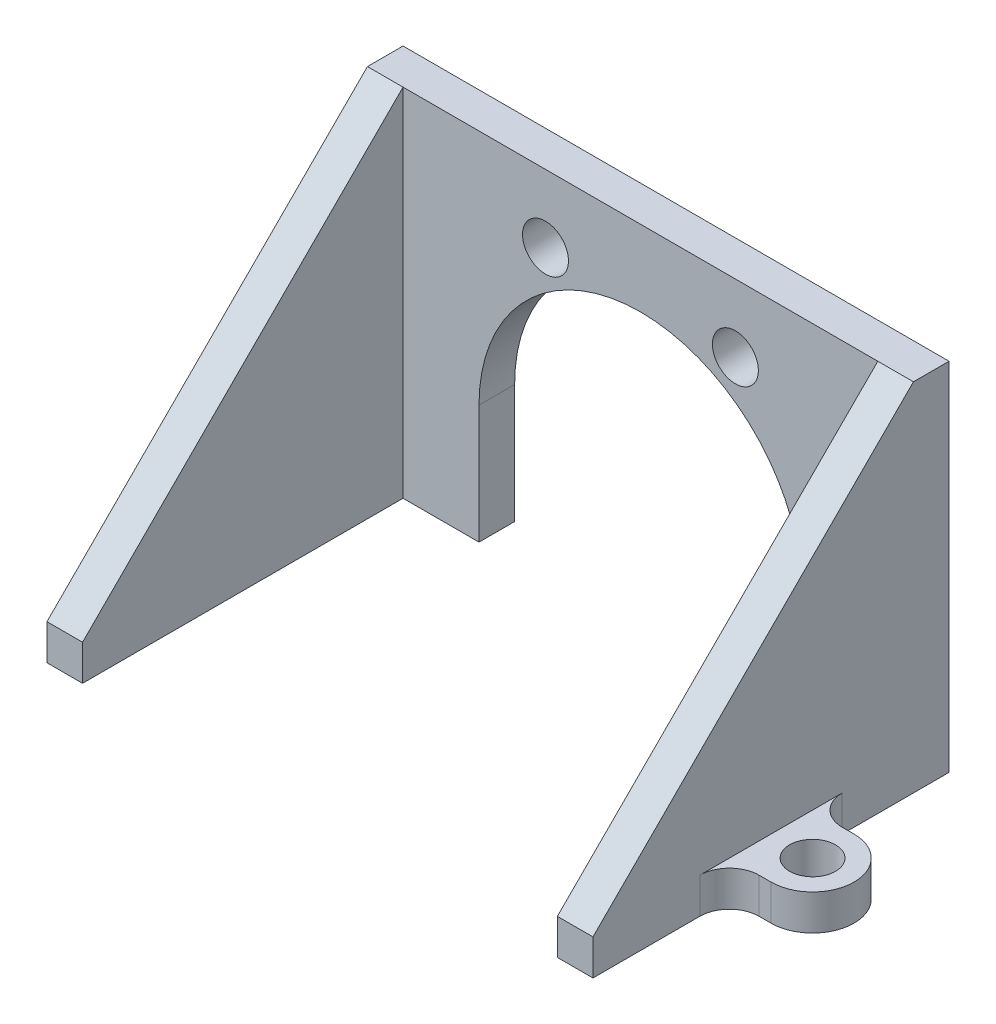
ISO-10303-21;
HEADER;
FILE_DESCRIPTION(('STEP AP214'),'2;1');
FILE_NAME('part.step','',(''),(''),'','','');
FILE_SCHEMA(('AUTOMOTIVE_DESIGN { 1 0 10303 214 1 1 1 1 }'));
ENDSEC;
DATA;
#1=APPLICATION_CONTEXT('core data for automotive mechanical design processes');
#2=APPLICATION_PROTOCOL_DEFINITION('international standard','automotive_design',2000,#1);
#3=PRODUCT_CONTEXT('',#1,'mechanical');
#4=PRODUCT('Part','Part','',(#3));
#5=PRODUCT_RELATED_PRODUCT_CATEGORY('part','',(#4));
#6=PRODUCT_DEFINITION_FORMATION('','',#4);
#7=PRODUCT_DEFINITION_CONTEXT('part definition',#1,'design');
#8=PRODUCT_DEFINITION('design','',#6,#7);
#9=PRODUCT_DEFINITION_SHAPE('','',#8);
#10=(LENGTH_UNIT() NAMED_UNIT(*) SI_UNIT(.MILLI.,.METRE.));
#11=(NAMED_UNIT(*) PLANE_ANGLE_UNIT() SI_UNIT($,.RADIAN.));
#12=(NAMED_UNIT(*) SI_UNIT($,.STERADIAN.) SOLID_ANGLE_UNIT());
#13=UNCERTAINTY_MEASURE_WITH_UNIT(LENGTH_MEASURE(1.E-05),#10,'distance_accuracy_value','');
#14=(GEOMETRIC_REPRESENTATION_CONTEXT(3) GLOBAL_UNCERTAINTY_ASSIGNED_CONTEXT((#13)) GLOBAL_UNIT_ASSIGNED_CONTEXT((#10,
#11,#12)) REPRESENTATION_CONTEXT('',''));
#15=CARTESIAN_POINT('',(0.,0.,0.));
#16=DIRECTION('',(0.,0.,1.));
#17=DIRECTION('',(1.,0.,0.));
#18=AXIS2_PLACEMENT_3D('',#15,#16,#17);
#19=CARTESIAN_POINT('',(29.21,0.,38.1));
#20=DIRECTION('',(0.,1.,0.));
#21=DIRECTION('',(0.,0.,1.));
#22=AXIS2_PLACEMENT_3D('',#19,#20,#21);
#23=PLANE('',#22);
#24=CARTESIAN_POINT('',(-33.655,0.,19.05));
#25=DIRECTION('',(0.,1.,0.));
#26=DIRECTION('',(0.,0.,1.));
#27=AXIS2_PLACEMENT_3D('',#24,#25,#26);
#28=CIRCLE('',#27,2.45744999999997);
#29=CARTESIAN_POINT('',(-33.655,0.,21.50745));
#30=VERTEX_POINT('',#29);
#31=EDGE_CURVE('E241',#30,#30,#28,.T.);
#32=ORIENTED_EDGE('',*,*,#31,.T.);
#33=EDGE_LOOP('',(#32));
#34=FACE_BOUND('',#33,.T.);
#35=DIRECTION('',(-1.,0.,0.));
#36=VECTOR('',#35,1.);
#37=CARTESIAN_POINT('',(29.21,0.,0.));
#38=LINE('',#37,#36);
#39=CARTESIAN_POINT('',(-17.272,0.,0.));
#40=VERTEX_POINT('',#39);
#41=CARTESIAN_POINT('',(-29.21,0.,0.));
#42=VERTEX_POINT('',#41);
#43=EDGE_CURVE('E409',#40,#42,#38,.T.);
#44=ORIENTED_EDGE('',*,*,#43,.F.);
#45=DIRECTION('',(0.,0.,-1.));
#46=VECTOR('',#45,1.);
#47=CARTESIAN_POINT('',(-17.272,0.,38.1));
#48=LINE('',#47,#46);
#49=CARTESIAN_POINT('',(-17.272,0.,3.81000000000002));
#50=VERTEX_POINT('',#49);
#51=EDGE_CURVE('E236',#50,#40,#48,.T.);
#52=ORIENTED_EDGE('',*,*,#51,.F.);
#53=DIRECTION('',(-1.,0.,0.));
#54=VECTOR('',#53,1.);
#55=CARTESIAN_POINT('',(-25.4,0.,3.81000000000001));
#56=LINE('',#55,#54);
#57=CARTESIAN_POINT('',(-25.4,0.,3.81000000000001));
#58=VERTEX_POINT('',#57);
#59=EDGE_CURVE('E300',#50,#58,#56,.T.);
#60=ORIENTED_EDGE('',*,*,#59,.T.);
#61=DIRECTION('',(0.,0.,1.));
#62=VECTOR('',#61,1.);
#63=CARTESIAN_POINT('',(-25.4,0.,3.81000000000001));
#64=LINE('',#63,#62);
#65=CARTESIAN_POINT('',(-25.4,0.,38.1));
#66=VERTEX_POINT('',#65);
#67=EDGE_CURVE('E304',#58,#66,#64,.T.);
#68=ORIENTED_EDGE('',*,*,#67,.T.);
#69=DIRECTION('',(-1.,0.,0.));
#70=VECTOR('',#69,1.);
#71=CARTESIAN_POINT('',(29.21,0.,38.1));
#72=LINE('',#71,#70);
#73=CARTESIAN_POINT('',(-29.21,0.,38.1));
#74=VERTEX_POINT('',#73);
#75=EDGE_CURVE('E397',#66,#74,#72,.T.);
#76=ORIENTED_EDGE('',*,*,#75,.T.);
#77=DIRECTION('',(0.,0.,-1.));
#78=VECTOR('',#77,1.);
#79=CARTESIAN_POINT('',(-29.21,0.,38.1));
#80=LINE('',#79,#78);
#81=CARTESIAN_POINT('',(-29.21,0.,26.67));
#82=VERTEX_POINT('',#81);
#83=EDGE_CURVE('E349',#74,#82,#80,.T.);
#84=ORIENTED_EDGE('',*,*,#83,.T.);
#85=CARTESIAN_POINT('',(-32.385,0.,26.67));
#86=DIRECTION('',(0.,1.,0.));
#87=DIRECTION('',(0.,0.,1.));
#88=AXIS2_PLACEMENT_3D('',#85,#86,#87);
#89=CIRCLE('',#88,3.175);
#90=CARTESIAN_POINT('',(-32.385,0.,23.495));
#91=VERTEX_POINT('',#90);
#92=EDGE_CURVE('E440',#82,#91,#89,.T.);
#93=ORIENTED_EDGE('',*,*,#92,.T.);
#94=DIRECTION('',(-1.,0.,0.));
#95=VECTOR('',#94,1.);
#96=CARTESIAN_POINT('',(-33.655,0.,23.495));
#97=LINE('',#96,#95);
#98=CARTESIAN_POINT('',(-33.655,0.,23.495));
#99=VERTEX_POINT('',#98);
#100=EDGE_CURVE('E275',#91,#99,#97,.T.);
#101=ORIENTED_EDGE('',*,*,#100,.T.);
#102=CARTESIAN_POINT('',(-33.655,0.,19.05));
#103=DIRECTION('',(0.,-1.,0.));
#104=DIRECTION('',(0.,0.,-1.));
#105=AXIS2_PLACEMENT_3D('',#102,#103,#104);
#106=CIRCLE('',#105,4.445);
#107=CARTESIAN_POINT('',(-33.655,0.,14.605));
#108=VERTEX_POINT('',#107);
#109=EDGE_CURVE('E269',#99,#108,#106,.T.);
#110=ORIENTED_EDGE('',*,*,#109,.T.);
#111=DIRECTION('',(1.,0.,0.));
#112=VECTOR('',#111,1.);
#113=CARTESIAN_POINT('',(-33.655,0.,14.605));
#114=LINE('',#113,#112);
#115=CARTESIAN_POINT('',(-32.385,0.,14.605));
#116=VERTEX_POINT('',#115);
#117=EDGE_CURVE('E285',#108,#116,#114,.T.);
#118=ORIENTED_EDGE('',*,*,#117,.T.);
#119=CARTESIAN_POINT('',(-32.385,0.,11.43));
#120=DIRECTION('',(0.,1.,0.));
#121=DIRECTION('',(0.,0.,1.));
#122=AXIS2_PLACEMENT_3D('',#119,#120,#121);
#123=CIRCLE('',#122,3.175);
#124=CARTESIAN_POINT('',(-29.21,0.,11.43));
#125=VERTEX_POINT('',#124);
#126=EDGE_CURVE('E357',#116,#125,#123,.T.);
#127=ORIENTED_EDGE('',*,*,#126,.T.);
#128=EDGE_CURVE('E315',#125,#42,#80,.T.);
#129=ORIENTED_EDGE('',*,*,#128,.T.);
#130=EDGE_LOOP('',(#44,#52,#60,#68,#76,#84,#93,#101,#110,#118,#127,#129));
#131=FACE_BOUND('',#130,.T.);
#132=ADVANCED_FACE('F39',(#34,#131),#23,.F.);
#133=CARTESIAN_POINT('',(-29.21,0.,0.));
#134=DIRECTION('',(1.,0.,0.));
#135=DIRECTION('',(0.,0.,-1.));
#136=AXIS2_PLACEMENT_3D('',#133,#134,#135);
#137=PLANE('',#136);
#138=ORIENTED_EDGE('',*,*,#128,.F.);
#139=DIRECTION('',(0.,-1.,0.));
#140=VECTOR('',#139,1.);
#141=CARTESIAN_POINT('',(-29.21,0.,11.43));
#142=LINE('',#141,#140);
#143=CARTESIAN_POINT('',(-29.21,3.81,11.43));
#144=VERTEX_POINT('',#143);
#145=EDGE_CURVE('E372',#125,#144,#142,.F.);
#146=ORIENTED_EDGE('',*,*,#145,.T.);
#147=DIRECTION('',(0.,0.,1.));
#148=VECTOR('',#147,1.);
#149=CARTESIAN_POINT('',(-29.21,3.81,14.605));
#150=LINE('',#149,#148);
#151=CARTESIAN_POINT('',(-29.21,3.81,26.67));
#152=VERTEX_POINT('',#151);
#153=EDGE_CURVE('E278',#144,#152,#150,.T.);
#154=ORIENTED_EDGE('',*,*,#153,.T.);
#155=DIRECTION('',(0.,-1.,0.));
#156=VECTOR('',#155,1.);
#157=CARTESIAN_POINT('',(-29.21,0.,26.67));
#158=LINE('',#157,#156);
#159=EDGE_CURVE('E368',#152,#82,#158,.T.);
#160=ORIENTED_EDGE('',*,*,#159,.T.);
#161=ORIENTED_EDGE('',*,*,#83,.F.);
#162=DIRECTION('',(0.,-1.,0.));
#163=VECTOR('',#162,1.);
#164=CARTESIAN_POINT('',(-29.21,3.81,38.1));
#165=LINE('',#164,#163);
#166=CARTESIAN_POINT('',(-29.21,3.81,38.1));
#167=VERTEX_POINT('',#166);
#168=EDGE_CURVE('E390',#167,#74,#165,.T.);
#169=ORIENTED_EDGE('',*,*,#168,.F.);
#170=DIRECTION('',(0.,-0.707106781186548,0.707106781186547));
#171=VECTOR('',#170,1.);
#172=CARTESIAN_POINT('',(-29.21,38.1,3.81000000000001));
#173=LINE('',#172,#171);
#174=CARTESIAN_POINT('',(-29.21,38.1,3.81000000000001));
#175=VERTEX_POINT('',#174);
#176=EDGE_CURVE('E387',#175,#167,#173,.T.);
#177=ORIENTED_EDGE('',*,*,#176,.F.);
#178=DIRECTION('',(0.,0.,1.));
#179=VECTOR('',#178,1.);
#180=CARTESIAN_POINT('',(-29.21,38.1,0.));
#181=LINE('',#180,#179);
#182=CARTESIAN_POINT('',(-29.21,38.1,0.));
#183=VERTEX_POINT('',#182);
#184=EDGE_CURVE('E384',#183,#175,#181,.T.);
#185=ORIENTED_EDGE('',*,*,#184,.F.);
#186=DIRECTION('',(0.,1.,0.));
#187=VECTOR('',#186,1.);
#188=CARTESIAN_POINT('',(-29.21,0.,0.));
#189=LINE('',#188,#187);
#190=EDGE_CURVE('E381',#42,#183,#189,.T.);
#191=ORIENTED_EDGE('',*,*,#190,.F.);
#192=EDGE_LOOP('',(#138,#146,#154,#160,#161,#169,#177,#185,#191));
#193=FACE_BOUND('',#192,.T.);
#194=ADVANCED_FACE('F417',(#193),#137,.F.);
#195=CARTESIAN_POINT('',(33.655,0.,19.05));
#196=DIRECTION('',(0.,1.,0.));
#197=DIRECTION('',(0.,0.,1.));
#198=AXIS2_PLACEMENT_3D('',#195,#196,#197);
#199=CIRCLE('',#198,2.45744999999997);
#200=CARTESIAN_POINT('',(33.655,0.,21.50745));
#201=VERTEX_POINT('',#200);
#202=EDGE_CURVE('E247',#201,#201,#199,.T.);
#203=ORIENTED_EDGE('',*,*,#202,.T.);
#204=EDGE_LOOP('',(#203));
#205=FACE_BOUND('',#204,.T.);
#206=CARTESIAN_POINT('',(25.4,0.,3.81000000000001));
#207=VERTEX_POINT('',#206);
#208=CARTESIAN_POINT('',(17.272,0.,3.81000000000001));
#209=VERTEX_POINT('',#208);
#210=EDGE_CURVE('E301',#207,#209,#56,.T.);
#211=ORIENTED_EDGE('',*,*,#210,.T.);
#212=DIRECTION('',(0.,0.,-1.));
#213=VECTOR('',#212,1.);
#214=CARTESIAN_POINT('',(17.272,0.,38.1));
#215=LINE('',#214,#213);
#216=CARTESIAN_POINT('',(17.272,0.,0.));
#217=VERTEX_POINT('',#216);
#218=EDGE_CURVE('E54',#209,#217,#215,.T.);
#219=ORIENTED_EDGE('',*,*,#218,.T.);
#220=CARTESIAN_POINT('',(29.21,0.,0.));
#221=VERTEX_POINT('',#220);
#222=EDGE_CURVE('E229',#221,#217,#38,.T.);
#223=ORIENTED_EDGE('',*,*,#222,.F.);
#224=DIRECTION('',(0.,0.,-1.));
#225=VECTOR('',#224,1.);
#226=CARTESIAN_POINT('',(29.21,0.,38.1));
#227=LINE('',#226,#225);
#228=CARTESIAN_POINT('',(29.21,0.,11.43));
#229=VERTEX_POINT('',#228);
#230=EDGE_CURVE('E322',#229,#221,#227,.T.);
#231=ORIENTED_EDGE('',*,*,#230,.F.);
#232=CARTESIAN_POINT('',(32.385,0.,11.43));
#233=DIRECTION('',(0.,1.,0.));
#234=DIRECTION('',(0.,0.,1.));
#235=AXIS2_PLACEMENT_3D('',#232,#233,#234);
#236=CIRCLE('',#235,3.175);
#237=CARTESIAN_POINT('',(32.385,0.,14.605));
#238=VERTEX_POINT('',#237);
#239=EDGE_CURVE('E451',#229,#238,#236,.T.);
#240=ORIENTED_EDGE('',*,*,#239,.T.);
#241=DIRECTION('',(1.,0.,0.));
#242=VECTOR('',#241,1.);
#243=CARTESIAN_POINT('',(33.655,0.,14.605));
#244=LINE('',#243,#242);
#245=CARTESIAN_POINT('',(33.655,0.,14.605));
#246=VERTEX_POINT('',#245);
#247=EDGE_CURVE('E255',#238,#246,#244,.T.);
#248=ORIENTED_EDGE('',*,*,#247,.T.);
#249=CARTESIAN_POINT('',(33.655,0.,19.05));
#250=DIRECTION('',(0.,-1.,0.));
#251=DIRECTION('',(0.,0.,1.));
#252=AXIS2_PLACEMENT_3D('',#249,#250,#251);
#253=CIRCLE('',#252,4.445);
#254=CARTESIAN_POINT('',(33.655,0.,23.495));
#255=VERTEX_POINT('',#254);
#256=EDGE_CURVE('E250',#246,#255,#253,.T.);
#257=ORIENTED_EDGE('',*,*,#256,.T.);
#258=DIRECTION('',(-1.,0.,0.));
#259=VECTOR('',#258,1.);
#260=CARTESIAN_POINT('',(33.655,0.,23.495));
#261=LINE('',#260,#259);
#262=CARTESIAN_POINT('',(32.385,0.,23.495));
#263=VERTEX_POINT('',#262);
#264=EDGE_CURVE('E265',#255,#263,#261,.T.);
#265=ORIENTED_EDGE('',*,*,#264,.T.);
#266=CARTESIAN_POINT('',(32.385,0.,26.67));
#267=DIRECTION('',(0.,1.,0.));
#268=DIRECTION('',(0.,0.,1.));
#269=AXIS2_PLACEMENT_3D('',#266,#267,#268);
#270=CIRCLE('',#269,3.175);
#271=CARTESIAN_POINT('',(29.21,0.,26.67));
#272=VERTEX_POINT('',#271);
#273=EDGE_CURVE('E446',#263,#272,#270,.T.);
#274=ORIENTED_EDGE('',*,*,#273,.T.);
#275=CARTESIAN_POINT('',(29.21,0.,38.1));
#276=VERTEX_POINT('',#275);
#277=EDGE_CURVE('E326',#276,#272,#227,.T.);
#278=ORIENTED_EDGE('',*,*,#277,.F.);
#279=CARTESIAN_POINT('',(25.4,0.,38.1));
#280=VERTEX_POINT('',#279);
#281=EDGE_CURVE('E393',#276,#280,#72,.T.);
#282=ORIENTED_EDGE('',*,*,#281,.T.);
#283=DIRECTION('',(0.,0.,1.));
#284=VECTOR('',#283,1.);
#285=CARTESIAN_POINT('',(25.4,0.,3.81000000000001));
#286=LINE('',#285,#284);
#287=EDGE_CURVE('E309',#207,#280,#286,.T.);
#288=ORIENTED_EDGE('',*,*,#287,.F.);
#289=EDGE_LOOP('',(#211,#219,#223,#231,#240,#248,#257,#265,#274,#278,#282,#288));
#290=FACE_BOUND('',#289,.T.);
#291=ADVANCED_FACE('F429',(#205,#290),#23,.F.);
#292=CARTESIAN_POINT('',(29.21,38.1,3.81000000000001));
#293=DIRECTION('',(0.,-0.707106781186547,-0.707106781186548));
#294=DIRECTION('',(0.,0.707106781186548,-0.707106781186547));
#295=AXIS2_PLACEMENT_3D('',#292,#293,#294);
#296=PLANE('',#295);
#297=DIRECTION('',(0.,-0.707106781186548,0.707106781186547));
#298=VECTOR('',#297,1.);
#299=CARTESIAN_POINT('',(-25.4,38.1,3.81));
#300=LINE('',#299,#298);
#301=CARTESIAN_POINT('',(-25.4,38.1,3.81000000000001));
#302=VERTEX_POINT('',#301);
#303=CARTESIAN_POINT('',(-25.4,3.81,38.1));
#304=VERTEX_POINT('',#303);
#305=EDGE_CURVE('E313',#302,#304,#300,.T.);
#306=ORIENTED_EDGE('',*,*,#305,.F.);
#307=DIRECTION('',(-1.,0.,0.));
#308=VECTOR('',#307,1.);
#309=CARTESIAN_POINT('',(29.21,38.1,3.81000000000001));
#310=LINE('',#309,#308);
#311=EDGE_CURVE('E401',#302,#175,#310,.T.);
#312=ORIENTED_EDGE('',*,*,#311,.T.);
#313=ORIENTED_EDGE('',*,*,#176,.T.);
#314=DIRECTION('',(-1.,0.,0.));
#315=VECTOR('',#314,1.);
#316=CARTESIAN_POINT('',(29.21,3.81,38.1));
#317=LINE('',#316,#315);
#318=EDGE_CURVE('E396',#304,#167,#317,.T.);
#319=ORIENTED_EDGE('',*,*,#318,.F.);
#320=EDGE_LOOP('',(#306,#312,#313,#319));
#321=FACE_BOUND('',#320,.T.);
#322=ADVANCED_FACE('F510',(#321),#296,.F.);
#323=DIRECTION('',(0.,0.707106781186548,-0.707106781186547));
#324=VECTOR('',#323,1.);
#325=CARTESIAN_POINT('',(25.4,38.1,3.81000000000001));
#326=LINE('',#325,#324);
#327=CARTESIAN_POINT('',(25.4,3.81,38.1));
#328=VERTEX_POINT('',#327);
#329=CARTESIAN_POINT('',(25.4,38.1,3.81000000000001));
#330=VERTEX_POINT('',#329);
#331=EDGE_CURVE('E311',#328,#330,#326,.T.);
#332=ORIENTED_EDGE('',*,*,#331,.F.);
#333=CARTESIAN_POINT('',(29.21,3.81,38.1));
#334=VERTEX_POINT('',#333);
#335=EDGE_CURVE('E398',#334,#328,#317,.T.);
#336=ORIENTED_EDGE('',*,*,#335,.F.);
#337=DIRECTION('',(0.,-0.707106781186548,0.707106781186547));
#338=VECTOR('',#337,1.);
#339=CARTESIAN_POINT('',(29.21,38.1,3.81000000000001));
#340=LINE('',#339,#338);
#341=CARTESIAN_POINT('',(29.21,38.1,3.81000000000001));
#342=VERTEX_POINT('',#341);
#343=EDGE_CURVE('E611',#342,#334,#340,.T.);
#344=ORIENTED_EDGE('',*,*,#343,.F.);
#345=EDGE_CURVE('E402',#342,#330,#310,.T.);
#346=ORIENTED_EDGE('',*,*,#345,.T.);
#347=EDGE_LOOP('',(#332,#336,#344,#346));
#348=FACE_BOUND('',#347,.T.);
#349=ADVANCED_FACE('F515',(#348),#296,.F.);
#350=CARTESIAN_POINT('',(29.21,3.81,38.1));
#351=DIRECTION('',(0.,0.,-1.));
#352=DIRECTION('',(-1.,0.,0.));
#353=AXIS2_PLACEMENT_3D('',#350,#351,#352);
#354=PLANE('',#353);
#355=DIRECTION('',(0.,1.,0.));
#356=VECTOR('',#355,1.);
#357=CARTESIAN_POINT('',(-25.4,38.1,38.1));
#358=LINE('',#357,#356);
#359=EDGE_CURVE('E289',#66,#304,#358,.T.);
#360=ORIENTED_EDGE('',*,*,#359,.T.);
#361=ORIENTED_EDGE('',*,*,#318,.T.);
#362=ORIENTED_EDGE('',*,*,#168,.T.);
#363=ORIENTED_EDGE('',*,*,#75,.F.);
#364=EDGE_LOOP('',(#360,#361,#362,#363));
#365=FACE_BOUND('',#364,.T.);
#366=ADVANCED_FACE('F590',(#365),#354,.F.);
#367=DIRECTION('',(0.,1.,0.));
#368=VECTOR('',#367,1.);
#369=CARTESIAN_POINT('',(25.4,3.81,38.1));
#370=LINE('',#369,#368);
#371=EDGE_CURVE('E369',#280,#328,#370,.T.);
#372=ORIENTED_EDGE('',*,*,#371,.F.);
#373=ORIENTED_EDGE('',*,*,#281,.F.);
#374=DIRECTION('',(0.,-1.,0.));
#375=VECTOR('',#374,1.);
#376=CARTESIAN_POINT('',(29.21,3.81,38.1));
#377=LINE('',#376,#375);
#378=EDGE_CURVE('E379',#334,#276,#377,.T.);
#379=ORIENTED_EDGE('',*,*,#378,.F.);
#380=ORIENTED_EDGE('',*,*,#335,.T.);
#381=EDGE_LOOP('',(#372,#373,#379,#380));
#382=FACE_BOUND('',#381,.T.);
#383=ADVANCED_FACE('F592',(#382),#354,.F.);
#384=CARTESIAN_POINT('',(29.21,0.,0.));
#385=DIRECTION('',(0.,0.,1.));
#386=DIRECTION('',(0.,-1.,0.));
#387=AXIS2_PLACEMENT_3D('',#384,#385,#386);
#388=PLANE('',#387);
#389=CARTESIAN_POINT('',(10.16,30.8453551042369,0.));
#390=DIRECTION('',(0.,0.,-1.));
#391=DIRECTION('',(0.,1.,0.));
#392=AXIS2_PLACEMENT_3D('',#389,#390,#391);
#393=CIRCLE('',#392,2.45744999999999);
#394=CARTESIAN_POINT('',(10.16,33.3028051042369,0.));
#395=VERTEX_POINT('',#394);
#396=EDGE_CURVE('E555',#395,#395,#393,.T.);
#397=ORIENTED_EDGE('',*,*,#396,.F.);
#398=EDGE_LOOP('',(#397));
#399=FACE_BOUND('',#398,.T.);
#400=CARTESIAN_POINT('',(-10.16,30.8453551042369,0.));
#401=DIRECTION('',(0.,0.,-1.));
#402=DIRECTION('',(0.,1.,0.));
#403=AXIS2_PLACEMENT_3D('',#400,#401,#402);
#404=CIRCLE('',#403,2.45744999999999);
#405=CARTESIAN_POINT('',(-10.16,33.3028051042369,0.));
#406=VERTEX_POINT('',#405);
#407=EDGE_CURVE('E560',#406,#406,#404,.T.);
#408=ORIENTED_EDGE('',*,*,#407,.F.);
#409=EDGE_LOOP('',(#408));
#410=FACE_BOUND('',#409,.T.);
#411=CARTESIAN_POINT('',(0.,12.7,0.));
#412=DIRECTION('',(0.,0.,-1.));
#413=DIRECTION('',(0.,1.,0.));
#414=AXIS2_PLACEMENT_3D('',#411,#412,#413);
#415=CIRCLE('',#414,17.272);
#416=CARTESIAN_POINT('',(-17.272,12.7,0.));
#417=VERTEX_POINT('',#416);
#418=CARTESIAN_POINT('',(17.272,12.7,0.));
#419=VERTEX_POINT('',#418);
#420=EDGE_CURVE('E215',#417,#419,#415,.T.);
#421=ORIENTED_EDGE('',*,*,#420,.F.);
#422=DIRECTION('',(0.,1.,0.));
#423=VECTOR('',#422,1.);
#424=CARTESIAN_POINT('',(-17.272,12.7,0.));
#425=LINE('',#424,#423);
#426=EDGE_CURVE('E212',#40,#417,#425,.T.);
#427=ORIENTED_EDGE('',*,*,#426,.F.);
#428=ORIENTED_EDGE('',*,*,#43,.T.);
#429=ORIENTED_EDGE('',*,*,#190,.T.);
#430=DIRECTION('',(-1.,0.,0.));
#431=VECTOR('',#430,1.);
#432=CARTESIAN_POINT('',(29.21,38.1,0.));
#433=LINE('',#432,#431);
#434=CARTESIAN_POINT('',(29.21,38.1,0.));
#435=VERTEX_POINT('',#434);
#436=EDGE_CURVE('E405',#435,#183,#433,.T.);
#437=ORIENTED_EDGE('',*,*,#436,.F.);
#438=DIRECTION('',(0.,1.,0.));
#439=VECTOR('',#438,1.);
#440=CARTESIAN_POINT('',(29.21,0.,0.));
#441=LINE('',#440,#439);
#442=EDGE_CURVE('E318',#221,#435,#441,.T.);
#443=ORIENTED_EDGE('',*,*,#442,.F.);
#444=ORIENTED_EDGE('',*,*,#222,.T.);
#445=DIRECTION('',(0.,-1.,0.));
#446=VECTOR('',#445,1.);
#447=CARTESIAN_POINT('',(17.272,0.,0.));
#448=LINE('',#447,#446);
#449=EDGE_CURVE('E208',#419,#217,#448,.T.);
#450=ORIENTED_EDGE('',*,*,#449,.F.);
#451=EDGE_LOOP('',(#421,#427,#428,#429,#437,#443,#444,#450));
#452=FACE_BOUND('',#451,.T.);
#453=ADVANCED_FACE('F226',(#399,#410,#452),#388,.F.);
#454=CARTESIAN_POINT('',(29.21,38.1,0.));
#455=DIRECTION('',(0.,-1.,0.));
#456=DIRECTION('',(0.,0.,-1.));
#457=AXIS2_PLACEMENT_3D('',#454,#455,#456);
#458=PLANE('',#457);
#459=ORIENTED_EDGE('',*,*,#184,.T.);
#460=ORIENTED_EDGE('',*,*,#311,.F.);
#461=DIRECTION('',(1.,0.,0.));
#462=VECTOR('',#461,1.);
#463=CARTESIAN_POINT('',(-25.4,38.1,3.81000000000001));
#464=LINE('',#463,#462);
#465=EDGE_CURVE('E294',#302,#330,#464,.T.);
#466=ORIENTED_EDGE('',*,*,#465,.T.);
#467=ORIENTED_EDGE('',*,*,#345,.F.);
#468=DIRECTION('',(0.,0.,1.));
#469=VECTOR('',#468,1.);
#470=CARTESIAN_POINT('',(29.21,38.1,0.));
#471=LINE('',#470,#469);
#472=EDGE_CURVE('E425',#435,#342,#471,.T.);
#473=ORIENTED_EDGE('',*,*,#472,.F.);
#474=ORIENTED_EDGE('',*,*,#436,.T.);
#475=EDGE_LOOP('',(#459,#460,#466,#467,#473,#474));
#476=FACE_BOUND('',#475,.T.);
#477=ADVANCED_FACE('F422',(#476),#458,.F.);
#478=CARTESIAN_POINT('',(29.21,0.,0.));
#479=DIRECTION('',(1.,0.,0.));
#480=DIRECTION('',(0.,0.,-1.));
#481=AXIS2_PLACEMENT_3D('',#478,#479,#480);
#482=PLANE('',#481);
#483=DIRECTION('',(0.,0.,-1.));
#484=VECTOR('',#483,1.);
#485=CARTESIAN_POINT('',(29.21,3.81,14.605));
#486=LINE('',#485,#484);
#487=CARTESIAN_POINT('',(29.21,3.81,26.67));
#488=VERTEX_POINT('',#487);
#489=CARTESIAN_POINT('',(29.21,3.81,11.43));
#490=VERTEX_POINT('',#489);
#491=EDGE_CURVE('E258',#488,#490,#486,.T.);
#492=ORIENTED_EDGE('',*,*,#491,.T.);
#493=DIRECTION('',(0.,-1.,0.));
#494=VECTOR('',#493,1.);
#495=CARTESIAN_POINT('',(29.21,0.,11.43));
#496=LINE('',#495,#494);
#497=EDGE_CURVE('E338',#490,#229,#496,.T.);
#498=ORIENTED_EDGE('',*,*,#497,.T.);
#499=ORIENTED_EDGE('',*,*,#230,.T.);
#500=ORIENTED_EDGE('',*,*,#442,.T.);
#501=ORIENTED_EDGE('',*,*,#472,.T.);
#502=ORIENTED_EDGE('',*,*,#343,.T.);
#503=ORIENTED_EDGE('',*,*,#378,.T.);
#504=ORIENTED_EDGE('',*,*,#277,.T.);
#505=DIRECTION('',(0.,-1.,0.));
#506=VECTOR('',#505,1.);
#507=CARTESIAN_POINT('',(29.21,3.81,26.67));
#508=LINE('',#507,#506);
#509=EDGE_CURVE('E458',#272,#488,#508,.F.);
#510=ORIENTED_EDGE('',*,*,#509,.T.);
#511=EDGE_LOOP('',(#492,#498,#499,#500,#501,#502,#503,#504,#510));
#512=FACE_BOUND('',#511,.T.);
#513=ADVANCED_FACE('F464',(#512),#482,.T.);
#514=CARTESIAN_POINT('',(-25.4,38.1,3.81000000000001));
#515=DIRECTION('',(1.,0.,0.));
#516=DIRECTION('',(0.,1.,0.));
#517=AXIS2_PLACEMENT_3D('',#514,#515,#516);
#518=PLANE('',#517);
#519=ORIENTED_EDGE('',*,*,#305,.T.);
#520=ORIENTED_EDGE('',*,*,#359,.F.);
#521=ORIENTED_EDGE('',*,*,#67,.F.);
#522=DIRECTION('',(0.,1.,0.));
#523=VECTOR('',#522,1.);
#524=CARTESIAN_POINT('',(-25.4,38.1,3.81000000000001));
#525=LINE('',#524,#523);
#526=EDGE_CURVE('E291',#58,#302,#525,.T.);
#527=ORIENTED_EDGE('',*,*,#526,.T.);
#528=EDGE_LOOP('',(#519,#520,#521,#527));
#529=FACE_BOUND('',#528,.T.);
#530=ADVANCED_FACE('F580',(#529),#518,.T.);
#531=CARTESIAN_POINT('',(25.4,38.1,3.81000000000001));
#532=DIRECTION('',(-1.,0.,0.));
#533=DIRECTION('',(0.,0.,1.));
#534=AXIS2_PLACEMENT_3D('',#531,#532,#533);
#535=PLANE('',#534);
#536=ORIENTED_EDGE('',*,*,#331,.T.);
#537=DIRECTION('',(0.,-1.,0.));
#538=VECTOR('',#537,1.);
#539=CARTESIAN_POINT('',(25.4,38.1,3.81000000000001));
#540=LINE('',#539,#538);
#541=EDGE_CURVE('E298',#330,#207,#540,.T.);
#542=ORIENTED_EDGE('',*,*,#541,.T.);
#543=ORIENTED_EDGE('',*,*,#287,.T.);
#544=ORIENTED_EDGE('',*,*,#371,.T.);
#545=EDGE_LOOP('',(#536,#542,#543,#544));
#546=FACE_BOUND('',#545,.T.);
#547=ADVANCED_FACE('F570',(#546),#535,.T.);
#548=CARTESIAN_POINT('',(0.,0.,3.81000000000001));
#549=DIRECTION('',(0.,0.,1.));
#550=DIRECTION('',(1.,0.,0.));
#551=AXIS2_PLACEMENT_3D('',#548,#549,#550);
#552=PLANE('',#551);
#553=CARTESIAN_POINT('',(10.16,30.8453551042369,3.81000000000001));
#554=DIRECTION('',(0.,0.,1.));
#555=DIRECTION('',(1.,0.,0.));
#556=AXIS2_PLACEMENT_3D('',#553,#554,#555);
#557=CIRCLE('',#556,2.45744999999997);
#558=CARTESIAN_POINT('',(12.61745,30.8453551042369,3.81000000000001));
#559=VERTEX_POINT('',#558);
#560=EDGE_CURVE('E552',#559,#559,#557,.T.);
#561=ORIENTED_EDGE('',*,*,#560,.F.);
#562=EDGE_LOOP('',(#561));
#563=FACE_BOUND('',#562,.T.);
#564=CARTESIAN_POINT('',(-10.16,30.8453551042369,3.81000000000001));
#565=DIRECTION('',(0.,0.,1.));
#566=DIRECTION('',(1.,0.,0.));
#567=AXIS2_PLACEMENT_3D('',#564,#565,#566);
#568=CIRCLE('',#567,2.45744999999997);
#569=CARTESIAN_POINT('',(-7.70255000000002,30.8453551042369,3.81000000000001));
#570=VERTEX_POINT('',#569);
#571=EDGE_CURVE('E223',#570,#570,#568,.T.);
#572=ORIENTED_EDGE('',*,*,#571,.F.);
#573=EDGE_LOOP('',(#572));
#574=FACE_BOUND('',#573,.T.);
#575=DIRECTION('',(0.,-1.,0.));
#576=VECTOR('',#575,1.);
#577=CARTESIAN_POINT('',(-17.272,0.,3.81000000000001));
#578=LINE('',#577,#576);
#579=CARTESIAN_POINT('',(-17.272,12.7,3.81000000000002));
#580=VERTEX_POINT('',#579);
#581=EDGE_CURVE('E11',#580,#50,#578,.T.);
#582=ORIENTED_EDGE('',*,*,#581,.F.);
#583=CARTESIAN_POINT('',(0.,12.7,3.81000000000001));
#584=DIRECTION('',(0.,0.,1.));
#585=DIRECTION('',(1.,0.,0.));
#586=AXIS2_PLACEMENT_3D('',#583,#584,#585);
#587=CIRCLE('',#586,17.272);
#588=CARTESIAN_POINT('',(17.272,12.7,3.81000000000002));
#589=VERTEX_POINT('',#588);
#590=EDGE_CURVE('E47',#589,#580,#587,.T.);
#591=ORIENTED_EDGE('',*,*,#590,.F.);
#592=DIRECTION('',(0.,1.,0.));
#593=VECTOR('',#592,1.);
#594=CARTESIAN_POINT('',(17.272,0.,3.81000000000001));
#595=LINE('',#594,#593);
#596=EDGE_CURVE('E209',#209,#589,#595,.T.);
#597=ORIENTED_EDGE('',*,*,#596,.F.);
#598=ORIENTED_EDGE('',*,*,#210,.F.);
#599=ORIENTED_EDGE('',*,*,#541,.F.);
#600=ORIENTED_EDGE('',*,*,#465,.F.);
#601=ORIENTED_EDGE('',*,*,#526,.F.);
#602=ORIENTED_EDGE('',*,*,#59,.F.);
#603=EDGE_LOOP('',(#582,#591,#597,#598,#599,#600,#601,#602));
#604=FACE_BOUND('',#603,.T.);
#605=ADVANCED_FACE('F435',(#563,#574,#604),#552,.T.);
#606=CARTESIAN_POINT('',(-33.655,3.81,19.05));
#607=DIRECTION('',(0.,-1.,0.));
#608=DIRECTION('',(0.,0.,-1.));
#609=AXIS2_PLACEMENT_3D('',#606,#607,#608);
#610=CYLINDRICAL_SURFACE('',#609,4.445);
#611=ORIENTED_EDGE('',*,*,#109,.F.);
#612=DIRECTION('',(0.,-1.,0.));
#613=VECTOR('',#612,1.);
#614=CARTESIAN_POINT('',(-33.655,3.81,23.495));
#615=LINE('',#614,#613);
#616=CARTESIAN_POINT('',(-33.655,3.81,23.495));
#617=VERTEX_POINT('',#616);
#618=EDGE_CURVE('E286',#617,#99,#615,.T.);
#619=ORIENTED_EDGE('',*,*,#618,.F.);
#620=CARTESIAN_POINT('',(-33.655,3.81,19.05));
#621=DIRECTION('',(0.,-1.,0.));
#622=DIRECTION('',(0.,0.,-1.));
#623=AXIS2_PLACEMENT_3D('',#620,#621,#622);
#624=CIRCLE('',#623,4.445);
#625=CARTESIAN_POINT('',(-33.655,3.81,14.605));
#626=VERTEX_POINT('',#625);
#627=EDGE_CURVE('E271',#617,#626,#624,.T.);
#628=ORIENTED_EDGE('',*,*,#627,.T.);
#629=DIRECTION('',(0.,-1.,0.));
#630=VECTOR('',#629,1.);
#631=CARTESIAN_POINT('',(-33.655,3.81,14.605));
#632=LINE('',#631,#630);
#633=EDGE_CURVE('E282',#626,#108,#632,.T.);
#634=ORIENTED_EDGE('',*,*,#633,.T.);
#635=EDGE_LOOP('',(#611,#619,#628,#634));
#636=FACE_BOUND('',#635,.T.);
#637=ADVANCED_FACE('F569',(#636),#610,.T.);
#638=CARTESIAN_POINT('',(-33.655,3.81,23.495));
#639=DIRECTION('',(0.,0.,1.));
#640=DIRECTION('',(1.,0.,0.));
#641=AXIS2_PLACEMENT_3D('',#638,#639,#640);
#642=PLANE('',#641);
#643=ORIENTED_EDGE('',*,*,#100,.F.);
#644=DIRECTION('',(0.,-1.,0.));
#645=VECTOR('',#644,1.);
#646=CARTESIAN_POINT('',(-32.385,3.81,23.495));
#647=LINE('',#646,#645);
#648=CARTESIAN_POINT('',(-32.385,3.81,23.495));
#649=VERTEX_POINT('',#648);
#650=EDGE_CURVE('E62',#91,#649,#647,.F.);
#651=ORIENTED_EDGE('',*,*,#650,.T.);
#652=DIRECTION('',(-1.,0.,0.));
#653=VECTOR('',#652,1.);
#654=CARTESIAN_POINT('',(-33.655,3.81,23.495));
#655=LINE('',#654,#653);
#656=EDGE_CURVE('E280',#649,#617,#655,.T.);
#657=ORIENTED_EDGE('',*,*,#656,.T.);
#658=ORIENTED_EDGE('',*,*,#618,.T.);
#659=EDGE_LOOP('',(#643,#651,#657,#658));
#660=FACE_BOUND('',#659,.T.);
#661=ADVANCED_FACE('F577',(#660),#642,.T.);
#662=CARTESIAN_POINT('',(-33.655,3.81,14.605));
#663=DIRECTION('',(0.,0.,-1.));
#664=DIRECTION('',(-1.,0.,0.));
#665=AXIS2_PLACEMENT_3D('',#662,#663,#664);
#666=PLANE('',#665);
#667=DIRECTION('',(1.,0.,0.));
#668=VECTOR('',#667,1.);
#669=CARTESIAN_POINT('',(-33.655,3.81,14.605));
#670=LINE('',#669,#668);
#671=CARTESIAN_POINT('',(-32.385,3.81,14.605));
#672=VERTEX_POINT('',#671);
#673=EDGE_CURVE('E274',#626,#672,#670,.T.);
#674=ORIENTED_EDGE('',*,*,#673,.T.);
#675=DIRECTION('',(0.,-1.,0.));
#676=VECTOR('',#675,1.);
#677=CARTESIAN_POINT('',(-32.385,3.81,14.605));
#678=LINE('',#677,#676);
#679=EDGE_CURVE('E365',#672,#116,#678,.T.);
#680=ORIENTED_EDGE('',*,*,#679,.T.);
#681=ORIENTED_EDGE('',*,*,#117,.F.);
#682=ORIENTED_EDGE('',*,*,#633,.F.);
#683=EDGE_LOOP('',(#674,#680,#681,#682));
#684=FACE_BOUND('',#683,.T.);
#685=ADVANCED_FACE('F362',(#684),#666,.T.);
#686=CARTESIAN_POINT('',(-33.655,3.81,19.05));
#687=DIRECTION('',(0.,-1.,0.));
#688=DIRECTION('',(0.,0.,-1.));
#689=AXIS2_PLACEMENT_3D('',#686,#687,#688);
#690=PLANE('',#689);
#691=CARTESIAN_POINT('',(-33.655,3.81,19.05));
#692=DIRECTION('',(0.,1.,0.));
#693=DIRECTION('',(0.,0.,1.));
#694=AXIS2_PLACEMENT_3D('',#691,#692,#693);
#695=CIRCLE('',#694,2.45744999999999);
#696=CARTESIAN_POINT('',(-33.655,3.81,21.50745));
#697=VERTEX_POINT('',#696);
#698=EDGE_CURVE('E235',#697,#697,#695,.T.);
#699=ORIENTED_EDGE('',*,*,#698,.F.);
#700=EDGE_LOOP('',(#699));
#701=FACE_BOUND('',#700,.T.);
#702=ORIENTED_EDGE('',*,*,#627,.F.);
#703=ORIENTED_EDGE('',*,*,#656,.F.);
#704=CARTESIAN_POINT('',(-32.385,3.81,26.67));
#705=DIRECTION('',(0.,-1.,0.));
#706=DIRECTION('',(0.,0.,-1.));
#707=AXIS2_PLACEMENT_3D('',#704,#705,#706);
#708=CIRCLE('',#707,3.175);
#709=EDGE_CURVE('E436',#649,#152,#708,.T.);
#710=ORIENTED_EDGE('',*,*,#709,.T.);
#711=ORIENTED_EDGE('',*,*,#153,.F.);
#712=CARTESIAN_POINT('',(-32.385,3.81,11.43));
#713=DIRECTION('',(0.,-1.,0.));
#714=DIRECTION('',(0.,0.,-1.));
#715=AXIS2_PLACEMENT_3D('',#712,#713,#714);
#716=CIRCLE('',#715,3.175);
#717=EDGE_CURVE('E453',#144,#672,#716,.T.);
#718=ORIENTED_EDGE('',*,*,#717,.T.);
#719=ORIENTED_EDGE('',*,*,#673,.F.);
#720=EDGE_LOOP('',(#702,#703,#710,#711,#718,#719));
#721=FACE_BOUND('',#720,.T.);
#722=ADVANCED_FACE('F456',(#701,#721),#690,.F.);
#723=CARTESIAN_POINT('',(33.655,3.81,19.05));
#724=DIRECTION('',(0.,-1.,0.));
#725=DIRECTION('',(0.,0.,-1.));
#726=AXIS2_PLACEMENT_3D('',#723,#724,#725);
#727=CYLINDRICAL_SURFACE('',#726,4.445);
#728=ORIENTED_EDGE('',*,*,#256,.F.);
#729=DIRECTION('',(0.,-1.,0.));
#730=VECTOR('',#729,1.);
#731=CARTESIAN_POINT('',(33.655,3.81,14.605));
#732=LINE('',#731,#730);
#733=CARTESIAN_POINT('',(33.655,3.81,14.605));
#734=VERTEX_POINT('',#733);
#735=EDGE_CURVE('E266',#734,#246,#732,.T.);
#736=ORIENTED_EDGE('',*,*,#735,.F.);
#737=CARTESIAN_POINT('',(33.655,3.81,19.05));
#738=DIRECTION('',(0.,-1.,0.));
#739=DIRECTION('',(0.,0.,1.));
#740=AXIS2_PLACEMENT_3D('',#737,#738,#739);
#741=CIRCLE('',#740,4.445);
#742=CARTESIAN_POINT('',(33.655,3.81,23.495));
#743=VERTEX_POINT('',#742);
#744=EDGE_CURVE('E251',#734,#743,#741,.T.);
#745=ORIENTED_EDGE('',*,*,#744,.T.);
#746=DIRECTION('',(0.,-1.,0.));
#747=VECTOR('',#746,1.);
#748=CARTESIAN_POINT('',(33.655,3.81,23.495));
#749=LINE('',#748,#747);
#750=EDGE_CURVE('E262',#743,#255,#749,.T.);
#751=ORIENTED_EDGE('',*,*,#750,.T.);
#752=EDGE_LOOP('',(#728,#736,#745,#751));
#753=FACE_BOUND('',#752,.T.);
#754=ADVANCED_FACE('F477',(#753),#727,.T.);
#755=CARTESIAN_POINT('',(33.655,3.81,14.605));
#756=DIRECTION('',(0.,0.,-1.));
#757=DIRECTION('',(-1.,0.,0.));
#758=AXIS2_PLACEMENT_3D('',#755,#756,#757);
#759=PLANE('',#758);
#760=ORIENTED_EDGE('',*,*,#247,.F.);
#761=DIRECTION('',(0.,-1.,0.));
#762=VECTOR('',#761,1.);
#763=CARTESIAN_POINT('',(32.385,3.81,14.605));
#764=LINE('',#763,#762);
#765=CARTESIAN_POINT('',(32.385,3.81,14.605));
#766=VERTEX_POINT('',#765);
#767=EDGE_CURVE('E339',#238,#766,#764,.F.);
#768=ORIENTED_EDGE('',*,*,#767,.T.);
#769=DIRECTION('',(1.,0.,0.));
#770=VECTOR('',#769,1.);
#771=CARTESIAN_POINT('',(33.655,3.81,14.605));
#772=LINE('',#771,#770);
#773=EDGE_CURVE('E260',#766,#734,#772,.T.);
#774=ORIENTED_EDGE('',*,*,#773,.T.);
#775=ORIENTED_EDGE('',*,*,#735,.T.);
#776=EDGE_LOOP('',(#760,#768,#774,#775));
#777=FACE_BOUND('',#776,.T.);
#778=ADVANCED_FACE('F471',(#777),#759,.T.);
#779=CARTESIAN_POINT('',(33.655,3.81,23.495));
#780=DIRECTION('',(0.,0.,1.));
#781=DIRECTION('',(1.,0.,0.));
#782=AXIS2_PLACEMENT_3D('',#779,#780,#781);
#783=PLANE('',#782);
#784=DIRECTION('',(-1.,0.,0.));
#785=VECTOR('',#784,1.);
#786=CARTESIAN_POINT('',(33.655,3.81,23.495));
#787=LINE('',#786,#785);
#788=CARTESIAN_POINT('',(32.385,3.81,23.495));
#789=VERTEX_POINT('',#788);
#790=EDGE_CURVE('E254',#743,#789,#787,.T.);
#791=ORIENTED_EDGE('',*,*,#790,.T.);
#792=DIRECTION('',(0.,-1.,0.));
#793=VECTOR('',#792,1.);
#794=CARTESIAN_POINT('',(32.385,0.,23.495));
#795=LINE('',#794,#793);
#796=EDGE_CURVE('E341',#789,#263,#795,.T.);
#797=ORIENTED_EDGE('',*,*,#796,.T.);
#798=ORIENTED_EDGE('',*,*,#264,.F.);
#799=ORIENTED_EDGE('',*,*,#750,.F.);
#800=EDGE_LOOP('',(#791,#797,#798,#799));
#801=FACE_BOUND('',#800,.T.);
#802=ADVANCED_FACE('F482',(#801),#783,.T.);
#803=CARTESIAN_POINT('',(33.655,3.81,19.05));
#804=DIRECTION('',(0.,1.,0.));
#805=DIRECTION('',(0.,0.,1.));
#806=AXIS2_PLACEMENT_3D('',#803,#804,#805);
#807=PLANE('',#806);
#808=CARTESIAN_POINT('',(33.655,3.81,19.05));
#809=DIRECTION('',(0.,1.,0.));
#810=DIRECTION('',(0.,0.,1.));
#811=AXIS2_PLACEMENT_3D('',#808,#809,#810);
#812=CIRCLE('',#811,2.45744999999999);
#813=CARTESIAN_POINT('',(33.655,3.81,21.50745));
#814=VERTEX_POINT('',#813);
#815=EDGE_CURVE('E244',#814,#814,#812,.T.);
#816=ORIENTED_EDGE('',*,*,#815,.F.);
#817=EDGE_LOOP('',(#816));
#818=FACE_BOUND('',#817,.T.);
#819=ORIENTED_EDGE('',*,*,#744,.F.);
#820=ORIENTED_EDGE('',*,*,#773,.F.);
#821=CARTESIAN_POINT('',(32.385,3.81,11.43));
#822=DIRECTION('',(0.,1.,0.));
#823=DIRECTION('',(0.,0.,1.));
#824=AXIS2_PLACEMENT_3D('',#821,#822,#823);
#825=CIRCLE('',#824,3.175);
#826=EDGE_CURVE('E448',#766,#490,#825,.F.);
#827=ORIENTED_EDGE('',*,*,#826,.T.);
#828=ORIENTED_EDGE('',*,*,#491,.F.);
#829=CARTESIAN_POINT('',(32.385,3.81,26.67));
#830=DIRECTION('',(0.,1.,0.));
#831=DIRECTION('',(0.,0.,1.));
#832=AXIS2_PLACEMENT_3D('',#829,#830,#831);
#833=CIRCLE('',#832,3.175);
#834=EDGE_CURVE('E444',#488,#789,#833,.F.);
#835=ORIENTED_EDGE('',*,*,#834,.T.);
#836=ORIENTED_EDGE('',*,*,#790,.F.);
#837=EDGE_LOOP('',(#819,#820,#827,#828,#835,#836));
#838=FACE_BOUND('',#837,.T.);
#839=ADVANCED_FACE('F488',(#818,#838),#807,.T.);
#840=CARTESIAN_POINT('',(-32.385,3.81,11.43));
#841=DIRECTION('',(0.,-1.,0.));
#842=DIRECTION('',(0.,0.,-1.));
#843=AXIS2_PLACEMENT_3D('',#840,#841,#842);
#844=CYLINDRICAL_SURFACE('',#843,3.175);
#845=ORIENTED_EDGE('',*,*,#717,.F.);
#846=ORIENTED_EDGE('',*,*,#145,.F.);
#847=ORIENTED_EDGE('',*,*,#126,.F.);
#848=ORIENTED_EDGE('',*,*,#679,.F.);
#849=EDGE_LOOP('',(#845,#846,#847,#848));
#850=FACE_BOUND('',#849,.T.);
#851=ADVANCED_FACE('F457',(#850),#844,.F.);
#852=CARTESIAN_POINT('',(32.385,0.,11.43));
#853=DIRECTION('',(0.,1.,0.));
#854=DIRECTION('',(0.,0.,1.));
#855=AXIS2_PLACEMENT_3D('',#852,#853,#854);
#856=CYLINDRICAL_SURFACE('',#855,3.175);
#857=ORIENTED_EDGE('',*,*,#826,.F.);
#858=ORIENTED_EDGE('',*,*,#767,.F.);
#859=ORIENTED_EDGE('',*,*,#239,.F.);
#860=ORIENTED_EDGE('',*,*,#497,.F.);
#861=EDGE_LOOP('',(#857,#858,#859,#860));
#862=FACE_BOUND('',#861,.T.);
#863=ADVANCED_FACE('F467',(#862),#856,.F.);
#864=CARTESIAN_POINT('',(32.385,3.81,26.67));
#865=DIRECTION('',(0.,1.,0.));
#866=DIRECTION('',(0.,0.,1.));
#867=AXIS2_PLACEMENT_3D('',#864,#865,#866);
#868=CYLINDRICAL_SURFACE('',#867,3.175);
#869=ORIENTED_EDGE('',*,*,#834,.F.);
#870=ORIENTED_EDGE('',*,*,#509,.F.);
#871=ORIENTED_EDGE('',*,*,#273,.F.);
#872=ORIENTED_EDGE('',*,*,#796,.F.);
#873=EDGE_LOOP('',(#869,#870,#871,#872));
#874=FACE_BOUND('',#873,.T.);
#875=ADVANCED_FACE('F486',(#874),#868,.F.);
#876=CARTESIAN_POINT('',(-32.385,0.,26.67));
#877=DIRECTION('',(0.,-1.,0.));
#878=DIRECTION('',(0.,0.,-1.));
#879=AXIS2_PLACEMENT_3D('',#876,#877,#878);
#880=CYLINDRICAL_SURFACE('',#879,3.175);
#881=ORIENTED_EDGE('',*,*,#709,.F.);
#882=ORIENTED_EDGE('',*,*,#650,.F.);
#883=ORIENTED_EDGE('',*,*,#92,.F.);
#884=ORIENTED_EDGE('',*,*,#159,.F.);
#885=EDGE_LOOP('',(#881,#882,#883,#884));
#886=FACE_BOUND('',#885,.T.);
#887=ADVANCED_FACE('F41',(#886),#880,.F.);
#888=CARTESIAN_POINT('',(33.655,3.81,19.05));
#889=DIRECTION('',(0.,1.,0.));
#890=DIRECTION('',(0.,0.,1.));
#891=AXIS2_PLACEMENT_3D('',#888,#889,#890);
#892=CYLINDRICAL_SURFACE('',#891,2.45744999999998);
#893=ORIENTED_EDGE('',*,*,#202,.F.);
#894=EDGE_LOOP('',(#893));
#895=FACE_BOUND('',#894,.T.);
#896=ORIENTED_EDGE('',*,*,#815,.T.);
#897=EDGE_LOOP('',(#896));
#898=FACE_BOUND('',#897,.T.);
#899=ADVANCED_FACE('F520',(#895,#898),#892,.F.);
#900=CARTESIAN_POINT('',(-33.655,3.81,19.05));
#901=DIRECTION('',(0.,1.,0.));
#902=DIRECTION('',(0.,0.,1.));
#903=AXIS2_PLACEMENT_3D('',#900,#901,#902);
#904=CYLINDRICAL_SURFACE('',#903,2.45744999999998);
#905=ORIENTED_EDGE('',*,*,#31,.F.);
#906=EDGE_LOOP('',(#905));
#907=FACE_BOUND('',#906,.T.);
#908=ORIENTED_EDGE('',*,*,#698,.T.);
#909=EDGE_LOOP('',(#908));
#910=FACE_BOUND('',#909,.T.);
#911=ADVANCED_FACE('F523',(#907,#910),#904,.F.);
#912=CARTESIAN_POINT('',(0.,12.7,38.1));
#913=DIRECTION('',(0.,0.,-1.));
#914=DIRECTION('',(0.,1.,0.));
#915=AXIS2_PLACEMENT_3D('',#912,#913,#914);
#916=CYLINDRICAL_SURFACE('',#915,17.272);
#917=ORIENTED_EDGE('',*,*,#590,.T.);
#918=DIRECTION('',(0.,0.,-1.));
#919=VECTOR('',#918,1.);
#920=CARTESIAN_POINT('',(-17.272,12.7,38.1));
#921=LINE('',#920,#919);
#922=EDGE_CURVE('E218',#580,#417,#921,.T.);
#923=ORIENTED_EDGE('',*,*,#922,.T.);
#924=ORIENTED_EDGE('',*,*,#420,.T.);
#925=DIRECTION('',(0.,0.,-1.));
#926=VECTOR('',#925,1.);
#927=CARTESIAN_POINT('',(17.272,12.7,38.1));
#928=LINE('',#927,#926);
#929=EDGE_CURVE('E204',#589,#419,#928,.T.);
#930=ORIENTED_EDGE('',*,*,#929,.F.);
#931=EDGE_LOOP('',(#917,#923,#924,#930));
#932=FACE_BOUND('',#931,.T.);
#933=ADVANCED_FACE('F216',(#932),#916,.F.);
#934=CARTESIAN_POINT('',(-17.272,12.7,38.1));
#935=DIRECTION('',(-1.,0.,0.));
#936=DIRECTION('',(0.,0.,1.));
#937=AXIS2_PLACEMENT_3D('',#934,#935,#936);
#938=PLANE('',#937);
#939=ORIENTED_EDGE('',*,*,#581,.T.);
#940=ORIENTED_EDGE('',*,*,#51,.T.);
#941=ORIENTED_EDGE('',*,*,#426,.T.);
#942=ORIENTED_EDGE('',*,*,#922,.F.);
#943=EDGE_LOOP('',(#939,#940,#941,#942));
#944=FACE_BOUND('',#943,.T.);
#945=ADVANCED_FACE('F534',(#944),#938,.F.);
#946=CARTESIAN_POINT('',(17.272,0.,38.1));
#947=DIRECTION('',(1.,0.,0.));
#948=DIRECTION('',(0.,0.,-1.));
#949=AXIS2_PLACEMENT_3D('',#946,#947,#948);
#950=PLANE('',#949);
#951=ORIENTED_EDGE('',*,*,#596,.T.);
#952=ORIENTED_EDGE('',*,*,#929,.T.);
#953=ORIENTED_EDGE('',*,*,#449,.T.);
#954=ORIENTED_EDGE('',*,*,#218,.F.);
#955=EDGE_LOOP('',(#951,#952,#953,#954));
#956=FACE_BOUND('',#955,.T.);
#957=ADVANCED_FACE('F206',(#956),#950,.F.);
#958=CARTESIAN_POINT('',(-10.16,30.8453551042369,0.));
#959=DIRECTION('',(0.,0.,-1.));
#960=DIRECTION('',(0.,1.,0.));
#961=AXIS2_PLACEMENT_3D('',#958,#959,#960);
#962=CYLINDRICAL_SURFACE('',#961,2.45744999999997);
#963=ORIENTED_EDGE('',*,*,#571,.T.);
#964=EDGE_LOOP('',(#963));
#965=FACE_BOUND('',#964,.T.);
#966=ORIENTED_EDGE('',*,*,#407,.T.);
#967=EDGE_LOOP('',(#966));
#968=FACE_BOUND('',#967,.T.);
#969=ADVANCED_FACE('F537',(#965,#968),#962,.F.);
#970=CARTESIAN_POINT('',(10.16,30.8453551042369,0.));
#971=DIRECTION('',(0.,0.,-1.));
#972=DIRECTION('',(0.,1.,0.));
#973=AXIS2_PLACEMENT_3D('',#970,#971,#972);
#974=CYLINDRICAL_SURFACE('',#973,2.45744999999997);
#975=ORIENTED_EDGE('',*,*,#560,.T.);
#976=EDGE_LOOP('',(#975));
#977=FACE_BOUND('',#976,.T.);
#978=ORIENTED_EDGE('',*,*,#396,.T.);
#979=EDGE_LOOP('',(#978));
#980=FACE_BOUND('',#979,.T.);
#981=ADVANCED_FACE('F543',(#977,#980),#974,.F.);
#982=CLOSED_SHELL('',(#132,#194,#291,#322,#349,#366,#383,#453,#477,#513,#530,#547,#605,#637,
#661,#685,#722,#754,#778,#802,#839,#851,#863,#875,#887,#899,#911,#933,#945,#957,#969,#981));
#983=MANIFOLD_SOLID_BREP('B2',#982);
#984=ADVANCED_BREP_SHAPE_REPRESENTATION('',(#18,#983),#14);
#985=SHAPE_DEFINITION_REPRESENTATION(#9,#984);
ENDSEC;
END-ISO-10303-21;
